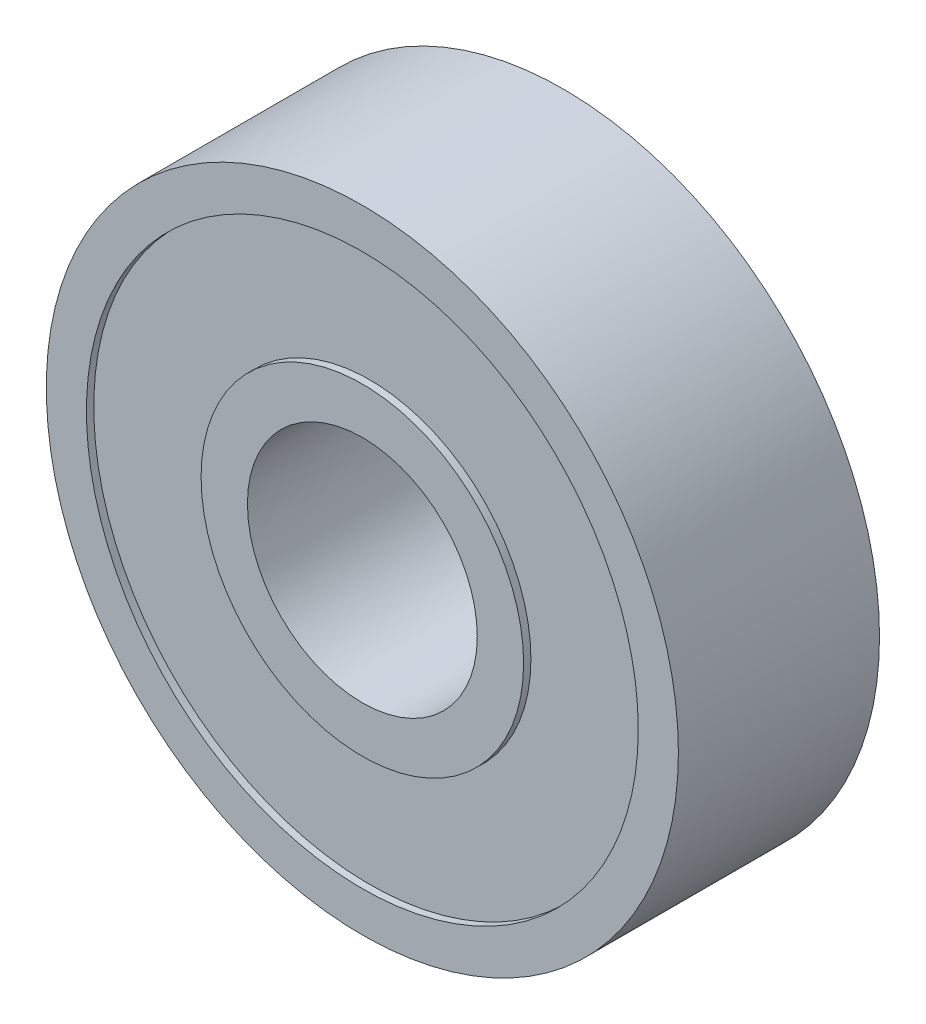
ISO-10303-21;
HEADER;
FILE_DESCRIPTION(('STEP AP214'),'2;1');
FILE_NAME('part.step','',(''),(''),'','','');
FILE_SCHEMA(('AUTOMOTIVE_DESIGN { 1 0 10303 214 1 1 1 1 }'));
ENDSEC;
DATA;
#1=APPLICATION_CONTEXT('core data for automotive mechanical design processes');
#2=APPLICATION_PROTOCOL_DEFINITION('international standard','automotive_design',2000,#1);
#3=PRODUCT_CONTEXT('',#1,'mechanical');
#4=PRODUCT('Part','Part','',(#3));
#5=PRODUCT_RELATED_PRODUCT_CATEGORY('part','',(#4));
#6=PRODUCT_DEFINITION_FORMATION('','',#4);
#7=PRODUCT_DEFINITION_CONTEXT('part definition',#1,'design');
#8=PRODUCT_DEFINITION('design','',#6,#7);
#9=PRODUCT_DEFINITION_SHAPE('','',#8);
#10=(LENGTH_UNIT() NAMED_UNIT(*) SI_UNIT(.MILLI.,.METRE.));
#11=(NAMED_UNIT(*) PLANE_ANGLE_UNIT() SI_UNIT($,.RADIAN.));
#12=(NAMED_UNIT(*) SI_UNIT($,.STERADIAN.) SOLID_ANGLE_UNIT());
#13=UNCERTAINTY_MEASURE_WITH_UNIT(LENGTH_MEASURE(1.E-05),#10,'distance_accuracy_value','');
#14=(GEOMETRIC_REPRESENTATION_CONTEXT(3) GLOBAL_UNCERTAINTY_ASSIGNED_CONTEXT((#13)) GLOBAL_UNIT_ASSIGNED_CONTEXT((#10,
#11,#12)) REPRESENTATION_CONTEXT('',''));
#15=CARTESIAN_POINT('',(0.,0.,0.));
#16=DIRECTION('',(0.,0.,1.));
#17=DIRECTION('',(1.,0.,0.));
#18=AXIS2_PLACEMENT_3D('',#15,#16,#17);
#19=CARTESIAN_POINT('',(0.,0.,7.));
#20=DIRECTION('',(0.,0.,-1.));
#21=DIRECTION('',(-1.,0.,0.));
#22=AXIS2_PLACEMENT_3D('',#19,#20,#21);
#23=CYLINDRICAL_SURFACE('',#22,9.603);
#24=CARTESIAN_POINT('',(0.,0.,0.));
#25=DIRECTION('',(0.,0.,1.));
#26=DIRECTION('',(1.,0.,0.));
#27=AXIS2_PLACEMENT_3D('',#24,#25,#26);
#28=CIRCLE('',#27,9.603);
#29=CARTESIAN_POINT('',(9.603,0.,0.));
#30=VERTEX_POINT('',#29);
#31=EDGE_CURVE('E76',#30,#30,#28,.T.);
#32=ORIENTED_EDGE('',*,*,#31,.F.);
#33=EDGE_LOOP('',(#32));
#34=FACE_BOUND('',#33,.T.);
#35=CARTESIAN_POINT('',(0.,0.,0.254000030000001));
#36=DIRECTION('',(0.,0.,1.));
#37=DIRECTION('',(1.,0.,0.));
#38=AXIS2_PLACEMENT_3D('',#35,#36,#37);
#39=CIRCLE('',#38,9.603);
#40=CARTESIAN_POINT('',(9.603,0.,0.254000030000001));
#41=VERTEX_POINT('',#40);
#42=EDGE_CURVE('E79',#41,#41,#39,.T.);
#43=ORIENTED_EDGE('',*,*,#42,.T.);
#44=EDGE_LOOP('',(#43));
#45=FACE_BOUND('',#44,.T.);
#46=ADVANCED_FACE('F53',(#34,#45),#23,.F.);
#47=CARTESIAN_POINT('',(0.,0.,6.746));
#48=DIRECTION('',(0.,0.,1.));
#49=DIRECTION('',(1.,0.,0.));
#50=AXIS2_PLACEMENT_3D('',#47,#48,#49);
#51=CIRCLE('',#50,9.603);
#52=CARTESIAN_POINT('',(9.603,0.,6.746));
#53=VERTEX_POINT('',#52);
#54=EDGE_CURVE('E11',#53,#53,#51,.T.);
#55=ORIENTED_EDGE('',*,*,#54,.F.);
#56=EDGE_LOOP('',(#55));
#57=FACE_BOUND('',#56,.T.);
#58=CARTESIAN_POINT('',(0.,0.,7.));
#59=DIRECTION('',(0.,0.,1.));
#60=DIRECTION('',(1.,0.,0.));
#61=AXIS2_PLACEMENT_3D('',#58,#59,#60);
#62=CIRCLE('',#61,9.603);
#63=CARTESIAN_POINT('',(9.603,0.,7.));
#64=VERTEX_POINT('',#63);
#65=EDGE_CURVE('E66',#64,#64,#62,.T.);
#66=ORIENTED_EDGE('',*,*,#65,.T.);
#67=EDGE_LOOP('',(#66));
#68=FACE_BOUND('',#67,.T.);
#69=ADVANCED_FACE('F55',(#57,#68),#23,.F.);
#70=CARTESIAN_POINT('',(0.,0.,7.));
#71=DIRECTION('',(0.,0.,-1.));
#72=DIRECTION('',(-1.,0.,0.));
#73=AXIS2_PLACEMENT_3D('',#70,#71,#72);
#74=CYLINDRICAL_SURFACE('',#73,11.);
#75=CARTESIAN_POINT('',(0.,0.,7.));
#76=DIRECTION('',(0.,0.,1.));
#77=DIRECTION('',(1.,0.,0.));
#78=AXIS2_PLACEMENT_3D('',#75,#76,#77);
#79=CIRCLE('',#78,11.);
#80=CARTESIAN_POINT('',(11.,0.,7.));
#81=VERTEX_POINT('',#80);
#82=EDGE_CURVE('E61',#81,#81,#79,.T.);
#83=ORIENTED_EDGE('',*,*,#82,.F.);
#84=EDGE_LOOP('',(#83));
#85=FACE_BOUND('',#84,.T.);
#86=CARTESIAN_POINT('',(0.,0.,0.));
#87=DIRECTION('',(0.,0.,1.));
#88=DIRECTION('',(1.,0.,0.));
#89=AXIS2_PLACEMENT_3D('',#86,#87,#88);
#90=CIRCLE('',#89,11.);
#91=CARTESIAN_POINT('',(11.,0.,0.));
#92=VERTEX_POINT('',#91);
#93=EDGE_CURVE('E72',#92,#92,#90,.T.);
#94=ORIENTED_EDGE('',*,*,#93,.T.);
#95=EDGE_LOOP('',(#94));
#96=FACE_BOUND('',#95,.T.);
#97=ADVANCED_FACE('F84',(#85,#96),#74,.T.);
#98=CARTESIAN_POINT('',(0.,0.,7.));
#99=DIRECTION('',(0.,0.,1.));
#100=DIRECTION('',(1.,0.,0.));
#101=AXIS2_PLACEMENT_3D('',#98,#99,#100);
#102=PLANE('',#101);
#103=ORIENTED_EDGE('',*,*,#65,.F.);
#104=EDGE_LOOP('',(#103));
#105=FACE_BOUND('',#104,.T.);
#106=ORIENTED_EDGE('',*,*,#82,.T.);
#107=EDGE_LOOP('',(#106));
#108=FACE_BOUND('',#107,.T.);
#109=ADVANCED_FACE('F89',(#105,#108),#102,.T.);
#110=CARTESIAN_POINT('',(0.,0.,0.));
#111=DIRECTION('',(0.,0.,1.));
#112=DIRECTION('',(1.,0.,0.));
#113=AXIS2_PLACEMENT_3D('',#110,#111,#112);
#114=PLANE('',#113);
#115=ORIENTED_EDGE('',*,*,#31,.T.);
#116=EDGE_LOOP('',(#115));
#117=FACE_BOUND('',#116,.T.);
#118=ORIENTED_EDGE('',*,*,#93,.F.);
#119=EDGE_LOOP('',(#118));
#120=FACE_BOUND('',#119,.T.);
#121=ADVANCED_FACE('F86',(#117,#120),#114,.F.);
#122=CARTESIAN_POINT('',(0.,0.,0.254000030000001));
#123=DIRECTION('',(0.,0.,1.));
#124=DIRECTION('',(1.,0.,0.));
#125=AXIS2_PLACEMENT_3D('',#122,#123,#124);
#126=PLANE('',#125);
#127=CARTESIAN_POINT('',(0.,0.,0.254000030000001));
#128=DIRECTION('',(0.,0.,1.));
#129=DIRECTION('',(1.,0.,0.));
#130=AXIS2_PLACEMENT_3D('',#127,#128,#129);
#131=CIRCLE('',#130,5.6129);
#132=CARTESIAN_POINT('',(5.6129,0.,0.254000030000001));
#133=VERTEX_POINT('',#132);
#134=EDGE_CURVE('E116',#133,#133,#131,.F.);
#135=ORIENTED_EDGE('',*,*,#134,.F.);
#136=EDGE_LOOP('',(#135));
#137=FACE_BOUND('',#136,.T.);
#138=ORIENTED_EDGE('',*,*,#42,.F.);
#139=EDGE_LOOP('',(#138));
#140=FACE_BOUND('',#139,.T.);
#141=ADVANCED_FACE('F88',(#137,#140),#126,.F.);
#142=CARTESIAN_POINT('',(0.,0.,6.746));
#143=DIRECTION('',(0.,0.,1.));
#144=DIRECTION('',(1.,0.,0.));
#145=AXIS2_PLACEMENT_3D('',#142,#143,#144);
#146=PLANE('',#145);
#147=CARTESIAN_POINT('',(0.,0.,6.746));
#148=DIRECTION('',(0.,0.,1.));
#149=DIRECTION('',(1.,0.,0.));
#150=AXIS2_PLACEMENT_3D('',#147,#148,#149);
#151=CIRCLE('',#150,5.6129);
#152=CARTESIAN_POINT('',(5.6129,0.,6.746));
#153=VERTEX_POINT('',#152);
#154=EDGE_CURVE('E113',#153,#153,#151,.T.);
#155=ORIENTED_EDGE('',*,*,#154,.F.);
#156=EDGE_LOOP('',(#155));
#157=FACE_BOUND('',#156,.T.);
#158=ORIENTED_EDGE('',*,*,#54,.T.);
#159=EDGE_LOOP('',(#158));
#160=FACE_BOUND('',#159,.T.);
#161=ADVANCED_FACE('F97',(#157,#160),#146,.T.);
#162=CARTESIAN_POINT('',(0.,0.,7.));
#163=DIRECTION('',(0.,0.,-1.));
#164=DIRECTION('',(-1.,0.,0.));
#165=AXIS2_PLACEMENT_3D('',#162,#163,#164);
#166=CYLINDRICAL_SURFACE('',#165,5.6129);
#167=CARTESIAN_POINT('',(0.,0.,0.));
#168=DIRECTION('',(0.,0.,1.));
#169=DIRECTION('',(1.,0.,0.));
#170=AXIS2_PLACEMENT_3D('',#167,#168,#169);
#171=CIRCLE('',#170,5.6129);
#172=CARTESIAN_POINT('',(5.6129,0.,0.));
#173=VERTEX_POINT('',#172);
#174=EDGE_CURVE('E123',#173,#173,#171,.T.);
#175=ORIENTED_EDGE('',*,*,#174,.T.);
#176=EDGE_LOOP('',(#175));
#177=FACE_BOUND('',#176,.T.);
#178=ORIENTED_EDGE('',*,*,#134,.T.);
#179=EDGE_LOOP('',(#178));
#180=FACE_BOUND('',#179,.T.);
#181=ADVANCED_FACE('F153',(#177,#180),#166,.T.);
#182=CARTESIAN_POINT('',(0.,0.,7.));
#183=DIRECTION('',(0.,0.,-1.));
#184=DIRECTION('',(-1.,0.,0.));
#185=AXIS2_PLACEMENT_3D('',#182,#183,#184);
#186=CYLINDRICAL_SURFACE('',#185,4.);
#187=CARTESIAN_POINT('',(0.,0.,7.));
#188=DIRECTION('',(0.,0.,1.));
#189=DIRECTION('',(1.,0.,0.));
#190=AXIS2_PLACEMENT_3D('',#187,#188,#189);
#191=CIRCLE('',#190,4.);
#192=CARTESIAN_POINT('',(4.,0.,7.));
#193=VERTEX_POINT('',#192);
#194=EDGE_CURVE('E127',#193,#193,#191,.T.);
#195=ORIENTED_EDGE('',*,*,#194,.T.);
#196=EDGE_LOOP('',(#195));
#197=FACE_BOUND('',#196,.T.);
#198=CARTESIAN_POINT('',(0.,0.,0.));
#199=DIRECTION('',(0.,0.,1.));
#200=DIRECTION('',(1.,0.,0.));
#201=AXIS2_PLACEMENT_3D('',#198,#199,#200);
#202=CIRCLE('',#201,4.);
#203=CARTESIAN_POINT('',(4.,0.,0.));
#204=VERTEX_POINT('',#203);
#205=EDGE_CURVE('E128',#204,#204,#202,.T.);
#206=ORIENTED_EDGE('',*,*,#205,.F.);
#207=EDGE_LOOP('',(#206));
#208=FACE_BOUND('',#207,.T.);
#209=ADVANCED_FACE('F139',(#197,#208),#186,.F.);
#210=ORIENTED_EDGE('',*,*,#154,.T.);
#211=EDGE_LOOP('',(#210));
#212=FACE_BOUND('',#211,.T.);
#213=CARTESIAN_POINT('',(0.,0.,7.));
#214=DIRECTION('',(0.,0.,1.));
#215=DIRECTION('',(1.,0.,0.));
#216=AXIS2_PLACEMENT_3D('',#213,#214,#215);
#217=CIRCLE('',#216,5.6129);
#218=CARTESIAN_POINT('',(5.6129,0.,7.));
#219=VERTEX_POINT('',#218);
#220=EDGE_CURVE('E122',#219,#219,#217,.T.);
#221=ORIENTED_EDGE('',*,*,#220,.F.);
#222=EDGE_LOOP('',(#221));
#223=FACE_BOUND('',#222,.T.);
#224=ADVANCED_FACE('F146',(#212,#223),#166,.T.);
#225=CARTESIAN_POINT('',(0.,0.,7.));
#226=DIRECTION('',(0.,0.,1.));
#227=DIRECTION('',(1.,0.,0.));
#228=AXIS2_PLACEMENT_3D('',#225,#226,#227);
#229=PLANE('',#228);
#230=ORIENTED_EDGE('',*,*,#194,.F.);
#231=EDGE_LOOP('',(#230));
#232=FACE_BOUND('',#231,.T.);
#233=ORIENTED_EDGE('',*,*,#220,.T.);
#234=EDGE_LOOP('',(#233));
#235=FACE_BOUND('',#234,.T.);
#236=ADVANCED_FACE('F142',(#232,#235),#229,.T.);
#237=CARTESIAN_POINT('',(0.,0.,0.));
#238=DIRECTION('',(0.,0.,1.));
#239=DIRECTION('',(1.,0.,0.));
#240=AXIS2_PLACEMENT_3D('',#237,#238,#239);
#241=PLANE('',#240);
#242=ORIENTED_EDGE('',*,*,#205,.T.);
#243=EDGE_LOOP('',(#242));
#244=FACE_BOUND('',#243,.T.);
#245=ORIENTED_EDGE('',*,*,#174,.F.);
#246=EDGE_LOOP('',(#245));
#247=FACE_BOUND('',#246,.T.);
#248=ADVANCED_FACE('F145',(#244,#247),#241,.F.);
#249=CLOSED_SHELL('',(#46,#69,#97,#109,#121,#141,#161,#181,#209,#224,#236,#248));
#250=MANIFOLD_SOLID_BREP('B2',#249);
#251=ADVANCED_BREP_SHAPE_REPRESENTATION('',(#18,#250),#14);
#252=SHAPE_DEFINITION_REPRESENTATION(#9,#251);
ENDSEC;
END-ISO-10303-21;
